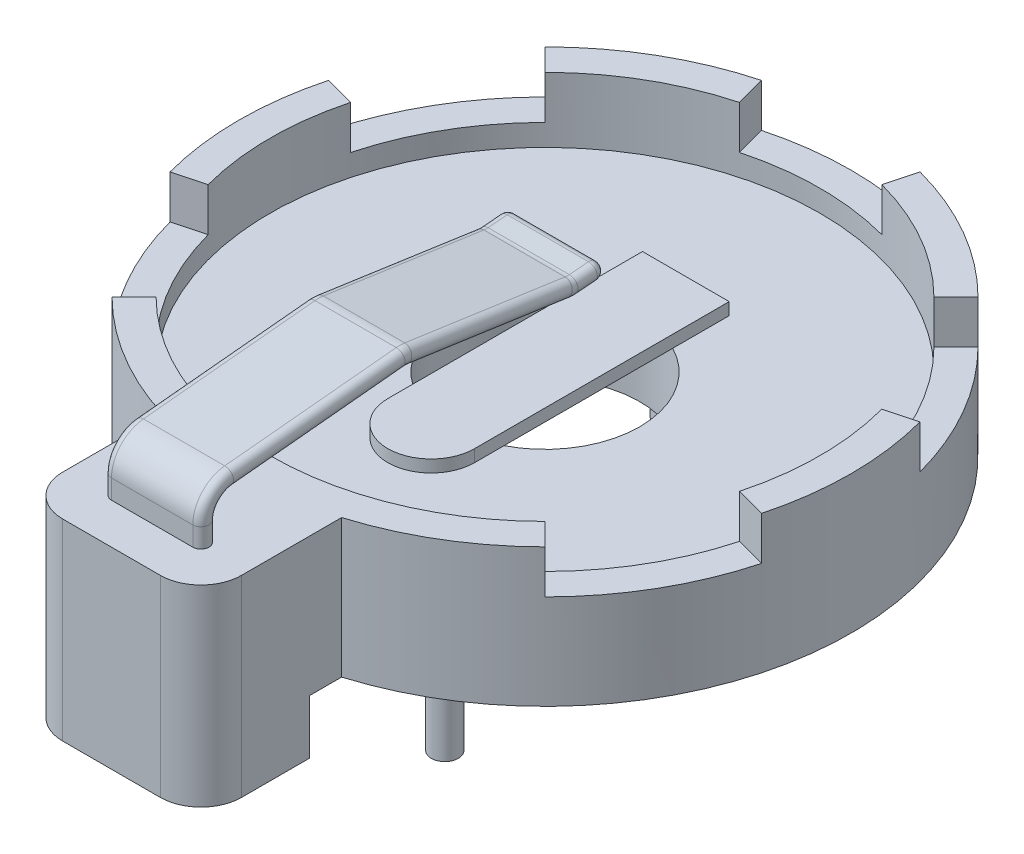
from build123d import *

# Parameters (mm, degrees)
ESQUISSE1_R             = 3.5
BOSS_EXTRU_1_DEPTH      = 5.1
ESQUISSE2_R             = 10.15
ENL_V_MAT_EXTRU_1_DEPTH = 2.4
ENL_V_MAT_EXTRU_2_DEPTH = 1.6
ESQUISSE4_R             = 0.5
BOSS_EXTRU_2_DEPTH      = 2.5
BOSS_EXTRU_3_START      = 2
ESQUISSE5_R             = 2
BOSS_EXTRU_3_DEPTH      = 2
ESQUISSE6_R             = 0.55
BOSS_EXTRU_4_DEPTH      = 2.1
BOSS_EXTRU_5_DEPTH      = 0.45
CONG_1_R                = 0.29


with BuildPart() as part:
    # Esquisse1 → Boss.-Extru.1 (new body)
    with BuildSketch(Plane(origin=(0, 0, 0), x_dir=(1, 0, 0), z_dir=(0, 1, 0))):
        with BuildLine():
            Line((-3.3, -10.807404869), (-3.3, -14.5))
            ThreePointArc((-3.3, -14.5), (-2.860660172, -15.560660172), (-1.8, -16))
            Line((-1.8, -16), (1.8, -16))
            ThreePointArc((1.8, -16), (2.860660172, -15.560660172), (3.3, -14.5))
            Line((3.3, -14.5), (3.3, -10.807404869))
            ThreePointArc((3.3, -10.807404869), (0, 11.3), (-3.3, -10.807404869))
        make_face()
        with Locations(Location((0, 0, 0), (0, 0, 270))):
            Circle(ESQUISSE1_R, mode=Mode.SUBTRACT)
    extrude(amount=BOSS_EXTRU_1_DEPTH)

    # Esquisse2 → Enl_v. mat.-Extru.1 (cut)
    with BuildSketch(Plane(origin=(0, 5.1, 0), x_dir=(1, 0, 0), z_dir=(0, 1, 0))):
        with Locations(Location((0, 0, 0), (0, 0, 270))):
            Circle(ESQUISSE2_R)
    extrude(amount=-ENL_V_MAT_EXTRU_1_DEPTH, mode=Mode.SUBTRACT)

    # Esquisse3 → Enl_v. mat.-Extru.2 (cut)
    with BuildSketch(Plane(origin=(0, 5.1, 0), x_dir=(1, 0, 0), z_dir=(0, 1, 0))):
        with BuildLine():
            Line((-2.963518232, 11.060000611), (-2.588190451, 9.659258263))
            ThreePointArc((-2.588190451, 9.659258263), (0, 10), (2.588190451, 9.659258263))
            Line((2.588190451, 9.659258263), (2.963518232, 11.060000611))
            ThreePointArc((2.963518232, 11.060000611), (0, 11.450155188), (-2.963518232, 11.060000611))
        make_face()
        with BuildLine():
            Line((8.096482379, 8.096482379), (7.071067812, 7.071067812))
            ThreePointArc((7.071067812, 7.071067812), (8.660254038, 5), (9.659258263, 2.588190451))
            Line((9.659258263, 2.588190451), (11.060000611, 2.963518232))
            ThreePointArc((11.060000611, 2.963518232), (9.91612527, 5.725077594), (8.096482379, 8.096482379))
        make_face()
        with BuildLine():
            Line((11.060000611, -2.963518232), (9.659258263, -2.588190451))
            ThreePointArc((9.659258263, -2.588190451), (8.660254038, -5), (7.071067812, -7.071067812))
            Line((7.071067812, -7.071067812), (8.096482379, -8.096482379))
            ThreePointArc((8.096482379, -8.096482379), (9.91612527, -5.725077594), (11.060000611, -2.963518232))
        make_face()
        with BuildLine():
            Line((-8.096482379, -8.096482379), (-7.071067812, -7.071067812))
            ThreePointArc((-7.071067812, -7.071067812), (-8.660254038, -5), (-9.659258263, -2.588190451))
            Line((-9.659258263, -2.588190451), (-11.060000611, -2.963518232))
            ThreePointArc((-11.060000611, -2.963518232), (-9.91612527, -5.725077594), (-8.096482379, -8.096482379))
        make_face()
        with BuildLine():
            Line((-11.060000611, 2.963518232), (-9.659258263, 2.588190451))
            ThreePointArc((-9.659258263, 2.588190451), (-8.660254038, 5), (-7.071067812, 7.071067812))
            Line((-7.071067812, 7.071067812), (-8.096482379, 8.096482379))
            ThreePointArc((-8.096482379, 8.096482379), (-9.91612527, 5.725077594), (-11.060000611, 2.963518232))
        make_face()
    extrude(amount=-ENL_V_MAT_EXTRU_2_DEPTH, mode=Mode.SUBTRACT)

    # Esquisse4 → Boss.-Extru.2 (add)
    with BuildSketch(Plane.XZ):
        with Locations(Location((-10.10521949, 0, 0), (0, 0, 90))):
            Circle(ESQUISSE4_R)
        with Locations(Location((5.052609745, 8.751376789, 0), (0, 0, 90))):
            Circle(ESQUISSE4_R)
        with Locations(Location((5.052609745, -8.751376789, 0), (0, 0, 90))):
            Circle(ESQUISSE4_R)
    extrude(amount=BOSS_EXTRU_2_DEPTH)

    # Esquisse5 → Boss.-Extru.3 (add)
    with BuildSketch(Plane.XZ.offset(BOSS_EXTRU_3_START)):
        with Locations(Location((0, -6.7, 0), (0, 0, 90))):
            Circle(ESQUISSE5_R)
        with BuildLine():
            Line((-3.3, 14.5), (-3.3, 12))
            Line((-3.3, 12), (3.3, 12))
            Line((3.3, 12), (3.3, 14.5))
            ThreePointArc((3.3, 14.5), (2.860660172, 15.560660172), (1.8, 16))
            Line((1.8, 16), (-1.8, 16))
            ThreePointArc((-1.8, 16), (-2.860660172, 15.560660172), (-3.3, 14.5))
        make_face()
    extrude(amount=-BOSS_EXTRU_3_DEPTH)

    # Esquisse6 → Boss.-Extru.4 (add)
    with BuildSketch(Plane.XZ.offset(2)):
        with Locations(Location((0, -6.7, 0), (0, 0, 270))):
            Circle(ESQUISSE6_R)
        with Locations(Location((0, 13.3, 0), (0, 0, 270))):
            Circle(ESQUISSE6_R)
    extrude(amount=BOSS_EXTRU_4_DEPTH)

    # Esquisse7 → Boss.-Extru.5 (add)
    with BuildSketch(Plane(origin=(0, 2.7, 0), x_dir=(1, 0, 0), z_dir=(0, 1, 0))):
        with BuildLine():
            Line((-1.6, -4.201548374), (-1.6, 5.198451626))
            Line((-1.6, 5.198451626), (1.6, 5.198451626))
            Line((1.6, 5.198451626), (1.6, -4.201548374))
            ThreePointArc((1.6, -4.201548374), (0, -5.801548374), (-1.6, -4.201548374))
        make_face()
    extrude(amount=BOSS_EXTRU_5_DEPTH)

    # Balayage1: sweep along a path in Esquisse9
    with BuildLine(Plane(origin=(0, 0, 0), x_dir=(0, 0, -1), z_dir=(1, 0, 0))) as balayage1_path:
        Line((-14.195341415, 5.1), (-14.195341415, 5.811786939))
        ThreePointArc((-14.195341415, 5.811786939), (-13.935858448, 6.483824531), (-13.292072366, 6.807097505))
        Line((-13.292072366, 6.807097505), (-6.960519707, 7.422440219))
        ThreePointArc((-6.960519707, 7.422440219), (-6.840855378, 7.426866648), (-6.721519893, 7.416957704))
        Line((-6.721519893, 7.416957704), (-0.801581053, 6.566079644))
        ThreePointArc((-0.801581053, 6.566079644), (-0.689675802, 6.556368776), (-0.577387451, 6.559269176))
        Line((-0.577387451, 6.559269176), (0.420092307, 6.641263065))
    # Esquisse8 → Balayage1 (sweep)
    with BuildSketch(Plane(origin=(0, 5.1, 0), x_dir=(1, 0, 0), z_dir=(0, 1, 0))):
        with BuildLine():
            Line((-1.5, -14.5), (1.5, -14.5))
            ThreePointArc((1.5, -14.5), (1.8, -14.2), (1.5, -13.9))
            Line((1.5, -13.9), (-1.5, -13.9))
            ThreePointArc((-1.5, -13.9), (-1.8, -14.2), (-1.5, -14.5))
        make_face()
    sweep(path=balayage1_path.line)

    # Cong_1
    cong_1_edges = [part.edges().sort_by_distance(p)[0] for p in [
        (-1.8, 6.64590599, -0.419710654),
        (0, 6.944897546, -0.395133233),
        (1.8, 6.64590599, -0.419710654),
        (0, 6.346914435, -0.444288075),
    ]]
    fillet(cong_1_edges, radius=CONG_1_R)


solid = part.part
